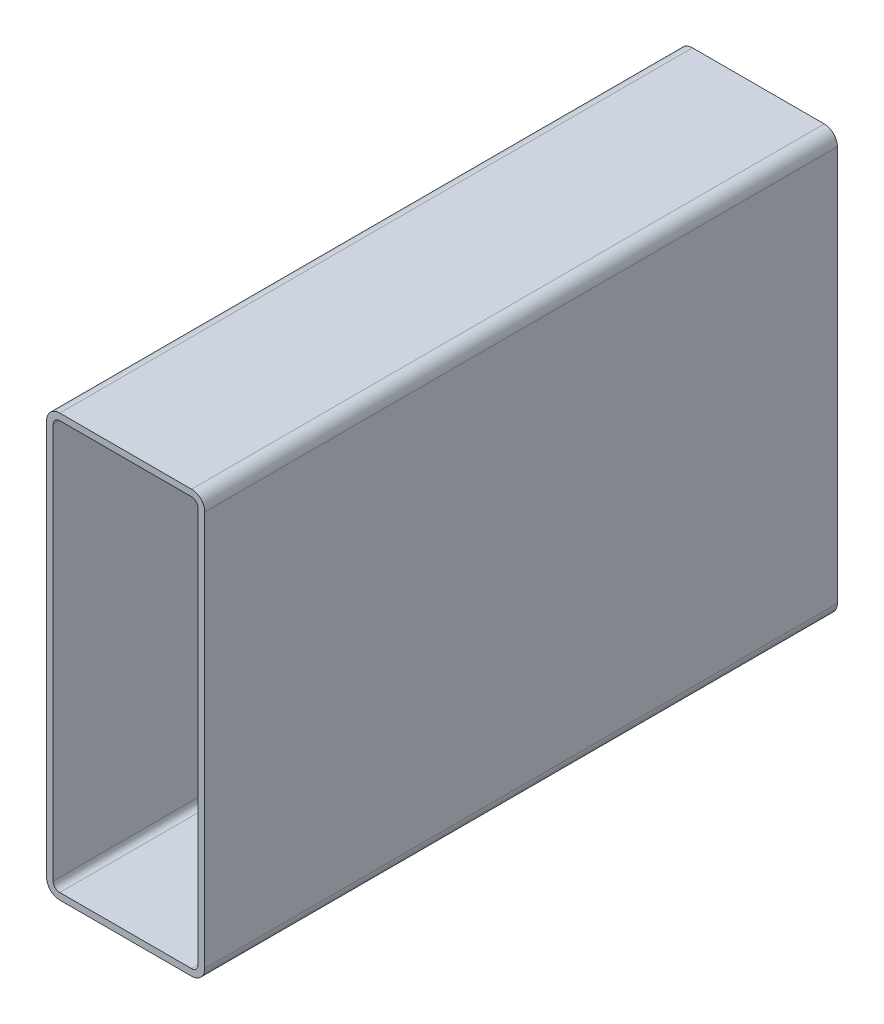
ISO-10303-21;
HEADER;
FILE_DESCRIPTION(('STEP AP214'),'2;1');
FILE_NAME('part.step','',(''),(''),'','','');
FILE_SCHEMA(('AUTOMOTIVE_DESIGN { 1 0 10303 214 1 1 1 1 }'));
ENDSEC;
DATA;
#1=APPLICATION_CONTEXT('core data for automotive mechanical design processes');
#2=APPLICATION_PROTOCOL_DEFINITION('international standard','automotive_design',2000,#1);
#3=PRODUCT_CONTEXT('',#1,'mechanical');
#4=PRODUCT('Part','Part','',(#3));
#5=PRODUCT_RELATED_PRODUCT_CATEGORY('part','',(#4));
#6=PRODUCT_DEFINITION_FORMATION('','',#4);
#7=PRODUCT_DEFINITION_CONTEXT('part definition',#1,'design');
#8=PRODUCT_DEFINITION('design','',#6,#7);
#9=PRODUCT_DEFINITION_SHAPE('','',#8);
#10=(LENGTH_UNIT() NAMED_UNIT(*) SI_UNIT(.MILLI.,.METRE.));
#11=(NAMED_UNIT(*) PLANE_ANGLE_UNIT() SI_UNIT($,.RADIAN.));
#12=(NAMED_UNIT(*) SI_UNIT($,.STERADIAN.) SOLID_ANGLE_UNIT());
#13=UNCERTAINTY_MEASURE_WITH_UNIT(LENGTH_MEASURE(1.E-05),#10,'distance_accuracy_value','');
#14=(GEOMETRIC_REPRESENTATION_CONTEXT(3) GLOBAL_UNCERTAINTY_ASSIGNED_CONTEXT((#13)) GLOBAL_UNIT_ASSIGNED_CONTEXT((#10,
#11,#12)) REPRESENTATION_CONTEXT('',''));
#15=CARTESIAN_POINT('',(0.,0.,0.));
#16=DIRECTION('',(0.,0.,1.));
#17=DIRECTION('',(1.,0.,0.));
#18=AXIS2_PLACEMENT_3D('',#15,#16,#17);
#19=CARTESIAN_POINT('',(8.83911603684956,198.816130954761,304.8));
#20=DIRECTION('',(0.,0.,1.));
#21=DIRECTION('',(1.,0.,0.));
#22=AXIS2_PLACEMENT_3D('',#19,#20,#21);
#23=PLANE('',#22);
#24=CARTESIAN_POINT('',(8.83911603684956,198.816130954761,304.8));
#25=DIRECTION('',(0.,0.,1.));
#26=DIRECTION('',(1.,0.,0.));
#27=AXIS2_PLACEMENT_3D('',#24,#25,#26);
#28=CIRCLE('',#27,6.35);
#29=CARTESIAN_POINT('',(8.83911603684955,205.166130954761,304.8));
#30=VERTEX_POINT('',#29);
#31=CARTESIAN_POINT('',(2.48911603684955,198.816130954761,304.8));
#32=VERTEX_POINT('',#31);
#33=EDGE_CURVE('E211',#30,#32,#28,.T.);
#34=ORIENTED_EDGE('',*,*,#33,.T.);
#35=DIRECTION('',(0.,-1.,0.));
#36=VECTOR('',#35,1.);
#37=CARTESIAN_POINT('',(2.48911603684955,8.31613095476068,304.8));
#38=LINE('',#37,#36);
#39=CARTESIAN_POINT('',(2.48911603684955,8.31613095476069,304.8));
#40=VERTEX_POINT('',#39);
#41=EDGE_CURVE('E214',#32,#40,#38,.T.);
#42=ORIENTED_EDGE('',*,*,#41,.T.);
#43=CARTESIAN_POINT('',(8.83911603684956,8.31613095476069,304.8));
#44=DIRECTION('',(0.,0.,1.));
#45=DIRECTION('',(1.,0.,0.));
#46=AXIS2_PLACEMENT_3D('',#43,#44,#45);
#47=CIRCLE('',#46,6.35);
#48=CARTESIAN_POINT('',(8.83911603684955,1.96613095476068,304.8));
#49=VERTEX_POINT('',#48);
#50=EDGE_CURVE('E217',#40,#49,#47,.T.);
#51=ORIENTED_EDGE('',*,*,#50,.T.);
#52=DIRECTION('',(1.,0.,0.));
#53=VECTOR('',#52,1.);
#54=CARTESIAN_POINT('',(72.3391160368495,1.96613095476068,304.8));
#55=LINE('',#54,#53);
#56=CARTESIAN_POINT('',(72.3391160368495,1.96613095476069,304.8));
#57=VERTEX_POINT('',#56);
#58=EDGE_CURVE('E219',#49,#57,#55,.T.);
#59=ORIENTED_EDGE('',*,*,#58,.T.);
#60=CARTESIAN_POINT('',(72.3391160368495,8.31613095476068,304.8));
#61=DIRECTION('',(0.,0.,1.));
#62=DIRECTION('',(1.,0.,0.));
#63=AXIS2_PLACEMENT_3D('',#60,#61,#62);
#64=CIRCLE('',#63,6.35);
#65=CARTESIAN_POINT('',(78.6891160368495,8.31613095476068,304.8));
#66=VERTEX_POINT('',#65);
#67=EDGE_CURVE('E221',#57,#66,#64,.T.);
#68=ORIENTED_EDGE('',*,*,#67,.T.);
#69=DIRECTION('',(0.,1.,0.));
#70=VECTOR('',#69,1.);
#71=CARTESIAN_POINT('',(78.6891160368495,198.816130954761,304.8));
#72=LINE('',#71,#70);
#73=CARTESIAN_POINT('',(78.6891160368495,198.816130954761,304.8));
#74=VERTEX_POINT('',#73);
#75=EDGE_CURVE('E223',#66,#74,#72,.T.);
#76=ORIENTED_EDGE('',*,*,#75,.T.);
#77=CARTESIAN_POINT('',(72.3391160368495,198.816130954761,304.8));
#78=DIRECTION('',(0.,0.,1.));
#79=DIRECTION('',(1.,0.,0.));
#80=AXIS2_PLACEMENT_3D('',#77,#78,#79);
#81=CIRCLE('',#80,6.34999999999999);
#82=CARTESIAN_POINT('',(72.3391160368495,205.166130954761,304.8));
#83=VERTEX_POINT('',#82);
#84=EDGE_CURVE('E225',#74,#83,#81,.T.);
#85=ORIENTED_EDGE('',*,*,#84,.T.);
#86=DIRECTION('',(-1.,0.,0.));
#87=VECTOR('',#86,1.);
#88=CARTESIAN_POINT('',(8.83911603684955,205.166130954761,304.8));
#89=LINE('',#88,#87);
#90=EDGE_CURVE('E227',#83,#30,#89,.T.);
#91=ORIENTED_EDGE('',*,*,#90,.T.);
#92=EDGE_LOOP('',(#34,#42,#51,#59,#68,#76,#85,#91));
#93=FACE_BOUND('',#92,.T.);
#94=DIRECTION('',(0.,-1.,0.));
#95=VECTOR('',#94,1.);
#96=CARTESIAN_POINT('',(5.66411603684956,8.31613095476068,304.8));
#97=LINE('',#96,#95);
#98=CARTESIAN_POINT('',(5.66411603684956,198.816130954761,304.8));
#99=VERTEX_POINT('',#98);
#100=CARTESIAN_POINT('',(5.66411603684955,8.31613095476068,304.8));
#101=VERTEX_POINT('',#100);
#102=EDGE_CURVE('E154',#99,#101,#97,.T.);
#103=ORIENTED_EDGE('',*,*,#102,.F.);
#104=CARTESIAN_POINT('',(8.83911603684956,198.816130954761,304.8));
#105=DIRECTION('',(0.,0.,1.));
#106=DIRECTION('',(1.,0.,0.));
#107=AXIS2_PLACEMENT_3D('',#104,#105,#106);
#108=CIRCLE('',#107,3.17499999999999);
#109=CARTESIAN_POINT('',(8.83911603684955,201.991130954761,304.8));
#110=VERTEX_POINT('',#109);
#111=EDGE_CURVE('E146',#110,#99,#108,.T.);
#112=ORIENTED_EDGE('',*,*,#111,.F.);
#113=DIRECTION('',(-1.,0.,0.));
#114=VECTOR('',#113,1.);
#115=CARTESIAN_POINT('',(8.83911603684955,201.991130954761,304.8));
#116=LINE('',#115,#114);
#117=CARTESIAN_POINT('',(72.3391160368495,201.991130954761,304.8));
#118=VERTEX_POINT('',#117);
#119=EDGE_CURVE('E179',#118,#110,#116,.T.);
#120=ORIENTED_EDGE('',*,*,#119,.F.);
#121=CARTESIAN_POINT('',(72.3391160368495,198.816130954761,304.8));
#122=DIRECTION('',(0.,0.,1.));
#123=DIRECTION('',(1.,0.,0.));
#124=AXIS2_PLACEMENT_3D('',#121,#122,#123);
#125=CIRCLE('',#124,3.175);
#126=CARTESIAN_POINT('',(75.5141160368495,198.816130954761,304.8));
#127=VERTEX_POINT('',#126);
#128=EDGE_CURVE('E177',#127,#118,#125,.T.);
#129=ORIENTED_EDGE('',*,*,#128,.F.);
#130=DIRECTION('',(0.,1.,0.));
#131=VECTOR('',#130,1.);
#132=CARTESIAN_POINT('',(75.5141160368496,198.816130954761,304.8));
#133=LINE('',#132,#131);
#134=CARTESIAN_POINT('',(75.5141160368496,8.31613095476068,304.8));
#135=VERTEX_POINT('',#134);
#136=EDGE_CURVE('E175',#135,#127,#133,.T.);
#137=ORIENTED_EDGE('',*,*,#136,.F.);
#138=CARTESIAN_POINT('',(72.3391160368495,8.31613095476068,304.8));
#139=DIRECTION('',(0.,0.,1.));
#140=DIRECTION('',(1.,0.,0.));
#141=AXIS2_PLACEMENT_3D('',#138,#139,#140);
#142=CIRCLE('',#141,3.17500000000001);
#143=CARTESIAN_POINT('',(72.3391160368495,5.14113095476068,304.8));
#144=VERTEX_POINT('',#143);
#145=EDGE_CURVE('E173',#144,#135,#142,.T.);
#146=ORIENTED_EDGE('',*,*,#145,.F.);
#147=DIRECTION('',(1.,0.,0.));
#148=VECTOR('',#147,1.);
#149=CARTESIAN_POINT('',(72.3391160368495,5.14113095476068,304.8));
#150=LINE('',#149,#148);
#151=CARTESIAN_POINT('',(8.83911603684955,5.14113095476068,304.8));
#152=VERTEX_POINT('',#151);
#153=EDGE_CURVE('E169',#152,#144,#150,.T.);
#154=ORIENTED_EDGE('',*,*,#153,.F.);
#155=CARTESIAN_POINT('',(8.83911603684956,8.31613095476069,304.8));
#156=DIRECTION('',(0.,0.,1.));
#157=DIRECTION('',(1.,0.,0.));
#158=AXIS2_PLACEMENT_3D('',#155,#156,#157);
#159=CIRCLE('',#158,3.175);
#160=EDGE_CURVE('E167',#101,#152,#159,.T.);
#161=ORIENTED_EDGE('',*,*,#160,.F.);
#162=EDGE_LOOP('',(#103,#112,#120,#129,#137,#146,#154,#161));
#163=FACE_BOUND('',#162,.T.);
#164=ADVANCED_FACE('F33',(#93,#163),#23,.T.);
#165=CARTESIAN_POINT('',(8.83911603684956,198.816130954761,0.));
#166=DIRECTION('',(0.,0.,1.));
#167=DIRECTION('',(1.,0.,0.));
#168=AXIS2_PLACEMENT_3D('',#165,#166,#167);
#169=PLANE('',#168);
#170=CARTESIAN_POINT('',(8.83911603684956,198.816130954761,0.));
#171=DIRECTION('',(0.,0.,1.));
#172=DIRECTION('',(1.,0.,0.));
#173=AXIS2_PLACEMENT_3D('',#170,#171,#172);
#174=CIRCLE('',#173,6.35);
#175=CARTESIAN_POINT('',(8.83911603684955,205.166130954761,0.));
#176=VERTEX_POINT('',#175);
#177=CARTESIAN_POINT('',(2.48911603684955,198.816130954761,0.));
#178=VERTEX_POINT('',#177);
#179=EDGE_CURVE('E162',#176,#178,#174,.T.);
#180=ORIENTED_EDGE('',*,*,#179,.F.);
#181=DIRECTION('',(-1.,0.,0.));
#182=VECTOR('',#181,1.);
#183=CARTESIAN_POINT('',(8.83911603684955,205.166130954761,0.));
#184=LINE('',#183,#182);
#185=CARTESIAN_POINT('',(72.3391160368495,205.166130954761,0.));
#186=VERTEX_POINT('',#185);
#187=EDGE_CURVE('E215',#186,#176,#184,.T.);
#188=ORIENTED_EDGE('',*,*,#187,.F.);
#189=CARTESIAN_POINT('',(72.3391160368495,198.816130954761,0.));
#190=DIRECTION('',(0.,0.,1.));
#191=DIRECTION('',(1.,0.,0.));
#192=AXIS2_PLACEMENT_3D('',#189,#190,#191);
#193=CIRCLE('',#192,6.34999999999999);
#194=CARTESIAN_POINT('',(78.6891160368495,198.816130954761,0.));
#195=VERTEX_POINT('',#194);
#196=EDGE_CURVE('E242',#195,#186,#193,.T.);
#197=ORIENTED_EDGE('',*,*,#196,.F.);
#198=DIRECTION('',(0.,1.,0.));
#199=VECTOR('',#198,1.);
#200=CARTESIAN_POINT('',(78.6891160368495,198.816130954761,0.));
#201=LINE('',#200,#199);
#202=CARTESIAN_POINT('',(78.6891160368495,8.31613095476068,0.));
#203=VERTEX_POINT('',#202);
#204=EDGE_CURVE('E240',#203,#195,#201,.T.);
#205=ORIENTED_EDGE('',*,*,#204,.F.);
#206=CARTESIAN_POINT('',(72.3391160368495,8.31613095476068,0.));
#207=DIRECTION('',(0.,0.,1.));
#208=DIRECTION('',(1.,0.,0.));
#209=AXIS2_PLACEMENT_3D('',#206,#207,#208);
#210=CIRCLE('',#209,6.35);
#211=CARTESIAN_POINT('',(72.3391160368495,1.96613095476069,0.));
#212=VERTEX_POINT('',#211);
#213=EDGE_CURVE('E238',#212,#203,#210,.T.);
#214=ORIENTED_EDGE('',*,*,#213,.F.);
#215=DIRECTION('',(1.,0.,0.));
#216=VECTOR('',#215,1.);
#217=CARTESIAN_POINT('',(72.3391160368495,1.96613095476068,0.));
#218=LINE('',#217,#216);
#219=CARTESIAN_POINT('',(8.83911603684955,1.96613095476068,0.));
#220=VERTEX_POINT('',#219);
#221=EDGE_CURVE('E236',#220,#212,#218,.T.);
#222=ORIENTED_EDGE('',*,*,#221,.F.);
#223=CARTESIAN_POINT('',(8.83911603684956,8.31613095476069,0.));
#224=DIRECTION('',(0.,0.,1.));
#225=DIRECTION('',(1.,0.,0.));
#226=AXIS2_PLACEMENT_3D('',#223,#224,#225);
#227=CIRCLE('',#226,6.35);
#228=CARTESIAN_POINT('',(2.48911603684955,8.31613095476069,0.));
#229=VERTEX_POINT('',#228);
#230=EDGE_CURVE('E234',#229,#220,#227,.T.);
#231=ORIENTED_EDGE('',*,*,#230,.F.);
#232=DIRECTION('',(0.,-1.,0.));
#233=VECTOR('',#232,1.);
#234=CARTESIAN_POINT('',(2.48911603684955,8.31613095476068,0.));
#235=LINE('',#234,#233);
#236=EDGE_CURVE('E232',#178,#229,#235,.T.);
#237=ORIENTED_EDGE('',*,*,#236,.F.);
#238=EDGE_LOOP('',(#180,#188,#197,#205,#214,#222,#231,#237));
#239=FACE_BOUND('',#238,.T.);
#240=CARTESIAN_POINT('',(8.83911603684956,198.816130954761,0.));
#241=DIRECTION('',(0.,0.,1.));
#242=DIRECTION('',(1.,0.,0.));
#243=AXIS2_PLACEMENT_3D('',#240,#241,#242);
#244=CIRCLE('',#243,3.17499999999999);
#245=CARTESIAN_POINT('',(8.83911603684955,201.991130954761,0.));
#246=VERTEX_POINT('',#245);
#247=CARTESIAN_POINT('',(5.66411603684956,198.816130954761,0.));
#248=VERTEX_POINT('',#247);
#249=EDGE_CURVE('E56',#246,#248,#244,.T.);
#250=ORIENTED_EDGE('',*,*,#249,.T.);
#251=DIRECTION('',(0.,-1.,0.));
#252=VECTOR('',#251,1.);
#253=CARTESIAN_POINT('',(5.66411603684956,8.31613095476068,0.));
#254=LINE('',#253,#252);
#255=CARTESIAN_POINT('',(5.66411603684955,8.31613095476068,0.));
#256=VERTEX_POINT('',#255);
#257=EDGE_CURVE('E161',#248,#256,#254,.T.);
#258=ORIENTED_EDGE('',*,*,#257,.T.);
#259=CARTESIAN_POINT('',(8.83911603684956,8.31613095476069,0.));
#260=DIRECTION('',(0.,0.,1.));
#261=DIRECTION('',(1.,0.,0.));
#262=AXIS2_PLACEMENT_3D('',#259,#260,#261);
#263=CIRCLE('',#262,3.175);
#264=CARTESIAN_POINT('',(8.83911603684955,5.14113095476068,0.));
#265=VERTEX_POINT('',#264);
#266=EDGE_CURVE('E183',#256,#265,#263,.T.);
#267=ORIENTED_EDGE('',*,*,#266,.T.);
#268=DIRECTION('',(1.,0.,0.));
#269=VECTOR('',#268,1.);
#270=CARTESIAN_POINT('',(72.3391160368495,5.14113095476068,0.));
#271=LINE('',#270,#269);
#272=CARTESIAN_POINT('',(72.3391160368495,5.14113095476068,0.));
#273=VERTEX_POINT('',#272);
#274=EDGE_CURVE('E186',#265,#273,#271,.T.);
#275=ORIENTED_EDGE('',*,*,#274,.T.);
#276=CARTESIAN_POINT('',(72.3391160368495,8.31613095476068,0.));
#277=DIRECTION('',(0.,0.,1.));
#278=DIRECTION('',(1.,0.,0.));
#279=AXIS2_PLACEMENT_3D('',#276,#277,#278);
#280=CIRCLE('',#279,3.17500000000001);
#281=CARTESIAN_POINT('',(75.5141160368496,8.31613095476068,0.));
#282=VERTEX_POINT('',#281);
#283=EDGE_CURVE('E189',#273,#282,#280,.T.);
#284=ORIENTED_EDGE('',*,*,#283,.T.);
#285=DIRECTION('',(0.,1.,0.));
#286=VECTOR('',#285,1.);
#287=CARTESIAN_POINT('',(75.5141160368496,198.816130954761,0.));
#288=LINE('',#287,#286);
#289=CARTESIAN_POINT('',(75.5141160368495,198.816130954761,0.));
#290=VERTEX_POINT('',#289);
#291=EDGE_CURVE('E192',#282,#290,#288,.T.);
#292=ORIENTED_EDGE('',*,*,#291,.T.);
#293=CARTESIAN_POINT('',(72.3391160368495,198.816130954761,0.));
#294=DIRECTION('',(0.,0.,1.));
#295=DIRECTION('',(1.,0.,0.));
#296=AXIS2_PLACEMENT_3D('',#293,#294,#295);
#297=CIRCLE('',#296,3.175);
#298=CARTESIAN_POINT('',(72.3391160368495,201.991130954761,0.));
#299=VERTEX_POINT('',#298);
#300=EDGE_CURVE('E195',#290,#299,#297,.T.);
#301=ORIENTED_EDGE('',*,*,#300,.T.);
#302=DIRECTION('',(-1.,0.,0.));
#303=VECTOR('',#302,1.);
#304=CARTESIAN_POINT('',(8.83911603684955,201.991130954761,0.));
#305=LINE('',#304,#303);
#306=EDGE_CURVE('E155',#299,#246,#305,.T.);
#307=ORIENTED_EDGE('',*,*,#306,.T.);
#308=EDGE_LOOP('',(#250,#258,#267,#275,#284,#292,#301,#307));
#309=FACE_BOUND('',#308,.T.);
#310=ADVANCED_FACE('F272',(#239,#309),#169,.F.);
#311=CARTESIAN_POINT('',(8.83911603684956,198.816130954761,304.8));
#312=DIRECTION('',(0.,0.,-1.));
#313=DIRECTION('',(-1.,0.,0.));
#314=AXIS2_PLACEMENT_3D('',#311,#312,#313);
#315=CYLINDRICAL_SURFACE('',#314,6.35);
#316=ORIENTED_EDGE('',*,*,#179,.T.);
#317=DIRECTION('',(0.,0.,-1.));
#318=VECTOR('',#317,1.);
#319=CARTESIAN_POINT('',(2.48911603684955,198.816130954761,304.8));
#320=LINE('',#319,#318);
#321=EDGE_CURVE('E11',#32,#178,#320,.T.);
#322=ORIENTED_EDGE('',*,*,#321,.F.);
#323=ORIENTED_EDGE('',*,*,#33,.F.);
#324=DIRECTION('',(0.,0.,-1.));
#325=VECTOR('',#324,1.);
#326=CARTESIAN_POINT('',(8.83911603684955,205.166130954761,304.8));
#327=LINE('',#326,#325);
#328=EDGE_CURVE('E229',#30,#176,#327,.T.);
#329=ORIENTED_EDGE('',*,*,#328,.T.);
#330=EDGE_LOOP('',(#316,#322,#323,#329));
#331=FACE_BOUND('',#330,.T.);
#332=ADVANCED_FACE('F35',(#331),#315,.T.);
#333=CARTESIAN_POINT('',(2.48911603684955,8.31613095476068,304.8));
#334=DIRECTION('',(1.,0.,0.));
#335=DIRECTION('',(0.,0.,-1.));
#336=AXIS2_PLACEMENT_3D('',#333,#334,#335);
#337=PLANE('',#336);
#338=ORIENTED_EDGE('',*,*,#236,.T.);
#339=DIRECTION('',(0.,0.,-1.));
#340=VECTOR('',#339,1.);
#341=CARTESIAN_POINT('',(2.48911603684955,8.31613095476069,304.8));
#342=LINE('',#341,#340);
#343=EDGE_CURVE('E41',#40,#229,#342,.T.);
#344=ORIENTED_EDGE('',*,*,#343,.F.);
#345=ORIENTED_EDGE('',*,*,#41,.F.);
#346=ORIENTED_EDGE('',*,*,#321,.T.);
#347=EDGE_LOOP('',(#338,#344,#345,#346));
#348=FACE_BOUND('',#347,.T.);
#349=ADVANCED_FACE('F289',(#348),#337,.F.);
#350=CARTESIAN_POINT('',(8.83911603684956,8.31613095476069,304.8));
#351=DIRECTION('',(0.,0.,-1.));
#352=DIRECTION('',(-1.,0.,0.));
#353=AXIS2_PLACEMENT_3D('',#350,#351,#352);
#354=CYLINDRICAL_SURFACE('',#353,6.35);
#355=ORIENTED_EDGE('',*,*,#230,.T.);
#356=DIRECTION('',(0.,0.,-1.));
#357=VECTOR('',#356,1.);
#358=CARTESIAN_POINT('',(8.83911603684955,1.96613095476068,304.8));
#359=LINE('',#358,#357);
#360=EDGE_CURVE('E259',#49,#220,#359,.T.);
#361=ORIENTED_EDGE('',*,*,#360,.F.);
#362=ORIENTED_EDGE('',*,*,#50,.F.);
#363=ORIENTED_EDGE('',*,*,#343,.T.);
#364=EDGE_LOOP('',(#355,#361,#362,#363));
#365=FACE_BOUND('',#364,.T.);
#366=ADVANCED_FACE('F266',(#365),#354,.T.);
#367=CARTESIAN_POINT('',(72.3391160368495,1.96613095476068,304.8));
#368=DIRECTION('',(0.,1.,0.));
#369=DIRECTION('',(0.,0.,1.));
#370=AXIS2_PLACEMENT_3D('',#367,#368,#369);
#371=PLANE('',#370);
#372=ORIENTED_EDGE('',*,*,#221,.T.);
#373=DIRECTION('',(0.,0.,-1.));
#374=VECTOR('',#373,1.);
#375=CARTESIAN_POINT('',(72.3391160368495,1.96613095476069,304.8));
#376=LINE('',#375,#374);
#377=EDGE_CURVE('E256',#57,#212,#376,.T.);
#378=ORIENTED_EDGE('',*,*,#377,.F.);
#379=ORIENTED_EDGE('',*,*,#58,.F.);
#380=ORIENTED_EDGE('',*,*,#360,.T.);
#381=EDGE_LOOP('',(#372,#378,#379,#380));
#382=FACE_BOUND('',#381,.T.);
#383=ADVANCED_FACE('F278',(#382),#371,.F.);
#384=CARTESIAN_POINT('',(72.3391160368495,8.31613095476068,304.8));
#385=DIRECTION('',(0.,0.,-1.));
#386=DIRECTION('',(-1.,0.,0.));
#387=AXIS2_PLACEMENT_3D('',#384,#385,#386);
#388=CYLINDRICAL_SURFACE('',#387,6.35);
#389=ORIENTED_EDGE('',*,*,#213,.T.);
#390=DIRECTION('',(0.,0.,-1.));
#391=VECTOR('',#390,1.);
#392=CARTESIAN_POINT('',(78.6891160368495,8.31613095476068,304.8));
#393=LINE('',#392,#391);
#394=EDGE_CURVE('E253',#66,#203,#393,.T.);
#395=ORIENTED_EDGE('',*,*,#394,.F.);
#396=ORIENTED_EDGE('',*,*,#67,.F.);
#397=ORIENTED_EDGE('',*,*,#377,.T.);
#398=EDGE_LOOP('',(#389,#395,#396,#397));
#399=FACE_BOUND('',#398,.T.);
#400=ADVANCED_FACE('F282',(#399),#388,.T.);
#401=CARTESIAN_POINT('',(78.6891160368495,198.816130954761,304.8));
#402=DIRECTION('',(-1.,0.,0.));
#403=DIRECTION('',(0.,0.,1.));
#404=AXIS2_PLACEMENT_3D('',#401,#402,#403);
#405=PLANE('',#404);
#406=ORIENTED_EDGE('',*,*,#204,.T.);
#407=DIRECTION('',(0.,0.,-1.));
#408=VECTOR('',#407,1.);
#409=CARTESIAN_POINT('',(78.6891160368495,198.816130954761,304.8));
#410=LINE('',#409,#408);
#411=EDGE_CURVE('E250',#74,#195,#410,.T.);
#412=ORIENTED_EDGE('',*,*,#411,.F.);
#413=ORIENTED_EDGE('',*,*,#75,.F.);
#414=ORIENTED_EDGE('',*,*,#394,.T.);
#415=EDGE_LOOP('',(#406,#412,#413,#414));
#416=FACE_BOUND('',#415,.T.);
#417=ADVANCED_FACE('F302',(#416),#405,.F.);
#418=CARTESIAN_POINT('',(72.3391160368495,198.816130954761,304.8));
#419=DIRECTION('',(0.,0.,-1.));
#420=DIRECTION('',(-1.,0.,0.));
#421=AXIS2_PLACEMENT_3D('',#418,#419,#420);
#422=CYLINDRICAL_SURFACE('',#421,6.34999999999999);
#423=ORIENTED_EDGE('',*,*,#196,.T.);
#424=DIRECTION('',(0.,0.,-1.));
#425=VECTOR('',#424,1.);
#426=CARTESIAN_POINT('',(72.3391160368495,205.166130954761,304.8));
#427=LINE('',#426,#425);
#428=EDGE_CURVE('E247',#83,#186,#427,.T.);
#429=ORIENTED_EDGE('',*,*,#428,.F.);
#430=ORIENTED_EDGE('',*,*,#84,.F.);
#431=ORIENTED_EDGE('',*,*,#411,.T.);
#432=EDGE_LOOP('',(#423,#429,#430,#431));
#433=FACE_BOUND('',#432,.T.);
#434=ADVANCED_FACE('F300',(#433),#422,.T.);
#435=CARTESIAN_POINT('',(8.83911603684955,205.166130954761,304.8));
#436=DIRECTION('',(0.,-1.,0.));
#437=DIRECTION('',(0.,0.,-1.));
#438=AXIS2_PLACEMENT_3D('',#435,#436,#437);
#439=PLANE('',#438);
#440=ORIENTED_EDGE('',*,*,#187,.T.);
#441=ORIENTED_EDGE('',*,*,#328,.F.);
#442=ORIENTED_EDGE('',*,*,#90,.F.);
#443=ORIENTED_EDGE('',*,*,#428,.T.);
#444=EDGE_LOOP('',(#440,#441,#442,#443));
#445=FACE_BOUND('',#444,.T.);
#446=ADVANCED_FACE('F295',(#445),#439,.F.);
#447=CARTESIAN_POINT('',(8.83911603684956,198.816130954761,304.8));
#448=DIRECTION('',(0.,0.,-1.));
#449=DIRECTION('',(-1.,0.,0.));
#450=AXIS2_PLACEMENT_3D('',#447,#448,#449);
#451=CYLINDRICAL_SURFACE('',#450,3.17499999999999);
#452=ORIENTED_EDGE('',*,*,#249,.F.);
#453=DIRECTION('',(0.,0.,-1.));
#454=VECTOR('',#453,1.);
#455=CARTESIAN_POINT('',(8.83911603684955,201.991130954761,304.8));
#456=LINE('',#455,#454);
#457=EDGE_CURVE('E150',#110,#246,#456,.T.);
#458=ORIENTED_EDGE('',*,*,#457,.F.);
#459=ORIENTED_EDGE('',*,*,#111,.T.);
#460=DIRECTION('',(0.,0.,-1.));
#461=VECTOR('',#460,1.);
#462=CARTESIAN_POINT('',(5.66411603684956,198.816130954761,304.8));
#463=LINE('',#462,#461);
#464=EDGE_CURVE('E149',#99,#248,#463,.T.);
#465=ORIENTED_EDGE('',*,*,#464,.T.);
#466=EDGE_LOOP('',(#452,#458,#459,#465));
#467=FACE_BOUND('',#466,.T.);
#468=ADVANCED_FACE('F148',(#467),#451,.F.);
#469=CARTESIAN_POINT('',(5.66411603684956,8.31613095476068,304.8));
#470=DIRECTION('',(1.,0.,0.));
#471=DIRECTION('',(0.,0.,-1.));
#472=AXIS2_PLACEMENT_3D('',#469,#470,#471);
#473=PLANE('',#472);
#474=ORIENTED_EDGE('',*,*,#257,.F.);
#475=ORIENTED_EDGE('',*,*,#464,.F.);
#476=ORIENTED_EDGE('',*,*,#102,.T.);
#477=DIRECTION('',(0.,0.,-1.));
#478=VECTOR('',#477,1.);
#479=CARTESIAN_POINT('',(5.66411603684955,8.31613095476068,304.8));
#480=LINE('',#479,#478);
#481=EDGE_CURVE('E163',#101,#256,#480,.T.);
#482=ORIENTED_EDGE('',*,*,#481,.T.);
#483=EDGE_LOOP('',(#474,#475,#476,#482));
#484=FACE_BOUND('',#483,.T.);
#485=ADVANCED_FACE('F158',(#484),#473,.T.);
#486=CARTESIAN_POINT('',(8.83911603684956,8.31613095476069,304.8));
#487=DIRECTION('',(0.,0.,-1.));
#488=DIRECTION('',(-1.,0.,0.));
#489=AXIS2_PLACEMENT_3D('',#486,#487,#488);
#490=CYLINDRICAL_SURFACE('',#489,3.175);
#491=ORIENTED_EDGE('',*,*,#266,.F.);
#492=ORIENTED_EDGE('',*,*,#481,.F.);
#493=ORIENTED_EDGE('',*,*,#160,.T.);
#494=DIRECTION('',(0.,0.,-1.));
#495=VECTOR('',#494,1.);
#496=CARTESIAN_POINT('',(8.83911603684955,5.14113095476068,304.8));
#497=LINE('',#496,#495);
#498=EDGE_CURVE('E208',#152,#265,#497,.T.);
#499=ORIENTED_EDGE('',*,*,#498,.T.);
#500=EDGE_LOOP('',(#491,#492,#493,#499));
#501=FACE_BOUND('',#500,.T.);
#502=ADVANCED_FACE('F327',(#501),#490,.F.);
#503=CARTESIAN_POINT('',(72.3391160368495,5.14113095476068,304.8));
#504=DIRECTION('',(0.,1.,0.));
#505=DIRECTION('',(0.,0.,1.));
#506=AXIS2_PLACEMENT_3D('',#503,#504,#505);
#507=PLANE('',#506);
#508=ORIENTED_EDGE('',*,*,#274,.F.);
#509=ORIENTED_EDGE('',*,*,#498,.F.);
#510=ORIENTED_EDGE('',*,*,#153,.T.);
#511=DIRECTION('',(0.,0.,-1.));
#512=VECTOR('',#511,1.);
#513=CARTESIAN_POINT('',(72.3391160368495,5.14113095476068,304.8));
#514=LINE('',#513,#512);
#515=EDGE_CURVE('E206',#144,#273,#514,.T.);
#516=ORIENTED_EDGE('',*,*,#515,.T.);
#517=EDGE_LOOP('',(#508,#509,#510,#516));
#518=FACE_BOUND('',#517,.T.);
#519=ADVANCED_FACE('F331',(#518),#507,.T.);
#520=CARTESIAN_POINT('',(72.3391160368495,8.31613095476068,304.8));
#521=DIRECTION('',(0.,0.,-1.));
#522=DIRECTION('',(-1.,0.,0.));
#523=AXIS2_PLACEMENT_3D('',#520,#521,#522);
#524=CYLINDRICAL_SURFACE('',#523,3.17500000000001);
#525=ORIENTED_EDGE('',*,*,#283,.F.);
#526=ORIENTED_EDGE('',*,*,#515,.F.);
#527=ORIENTED_EDGE('',*,*,#145,.T.);
#528=DIRECTION('',(0.,0.,-1.));
#529=VECTOR('',#528,1.);
#530=CARTESIAN_POINT('',(75.5141160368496,8.31613095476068,304.8));
#531=LINE('',#530,#529);
#532=EDGE_CURVE('E204',#135,#282,#531,.T.);
#533=ORIENTED_EDGE('',*,*,#532,.T.);
#534=EDGE_LOOP('',(#525,#526,#527,#533));
#535=FACE_BOUND('',#534,.T.);
#536=ADVANCED_FACE('F337',(#535),#524,.F.);
#537=CARTESIAN_POINT('',(75.5141160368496,198.816130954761,304.8));
#538=DIRECTION('',(-1.,0.,0.));
#539=DIRECTION('',(0.,0.,1.));
#540=AXIS2_PLACEMENT_3D('',#537,#538,#539);
#541=PLANE('',#540);
#542=ORIENTED_EDGE('',*,*,#291,.F.);
#543=ORIENTED_EDGE('',*,*,#532,.F.);
#544=ORIENTED_EDGE('',*,*,#136,.T.);
#545=DIRECTION('',(0.,0.,-1.));
#546=VECTOR('',#545,1.);
#547=CARTESIAN_POINT('',(75.5141160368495,198.816130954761,304.8));
#548=LINE('',#547,#546);
#549=EDGE_CURVE('E202',#127,#290,#548,.T.);
#550=ORIENTED_EDGE('',*,*,#549,.T.);
#551=EDGE_LOOP('',(#542,#543,#544,#550));
#552=FACE_BOUND('',#551,.T.);
#553=ADVANCED_FACE('F341',(#552),#541,.T.);
#554=CARTESIAN_POINT('',(72.3391160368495,198.816130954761,304.8));
#555=DIRECTION('',(0.,0.,-1.));
#556=DIRECTION('',(-1.,0.,0.));
#557=AXIS2_PLACEMENT_3D('',#554,#555,#556);
#558=CYLINDRICAL_SURFACE('',#557,3.175);
#559=ORIENTED_EDGE('',*,*,#300,.F.);
#560=ORIENTED_EDGE('',*,*,#549,.F.);
#561=ORIENTED_EDGE('',*,*,#128,.T.);
#562=DIRECTION('',(0.,0.,-1.));
#563=VECTOR('',#562,1.);
#564=CARTESIAN_POINT('',(72.3391160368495,201.991130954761,304.8));
#565=LINE('',#564,#563);
#566=EDGE_CURVE('E48',#118,#299,#565,.T.);
#567=ORIENTED_EDGE('',*,*,#566,.T.);
#568=EDGE_LOOP('',(#559,#560,#561,#567));
#569=FACE_BOUND('',#568,.T.);
#570=ADVANCED_FACE('F345',(#569),#558,.F.);
#571=CARTESIAN_POINT('',(8.83911603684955,201.991130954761,304.8));
#572=DIRECTION('',(0.,-1.,0.));
#573=DIRECTION('',(0.,0.,-1.));
#574=AXIS2_PLACEMENT_3D('',#571,#572,#573);
#575=PLANE('',#574);
#576=ORIENTED_EDGE('',*,*,#306,.F.);
#577=ORIENTED_EDGE('',*,*,#566,.F.);
#578=ORIENTED_EDGE('',*,*,#119,.T.);
#579=ORIENTED_EDGE('',*,*,#457,.T.);
#580=EDGE_LOOP('',(#576,#577,#578,#579));
#581=FACE_BOUND('',#580,.T.);
#582=ADVANCED_FACE('F349',(#581),#575,.T.);
#583=CLOSED_SHELL('',(#164,#310,#332,#349,#366,#383,#400,#417,#434,#446,#468,#485,#502,#519,
#536,#553,#570,#582));
#584=MANIFOLD_SOLID_BREP('B2',#583);
#585=ADVANCED_BREP_SHAPE_REPRESENTATION('',(#18,#584),#14);
#586=SHAPE_DEFINITION_REPRESENTATION(#9,#585);
ENDSEC;
END-ISO-10303-21;
